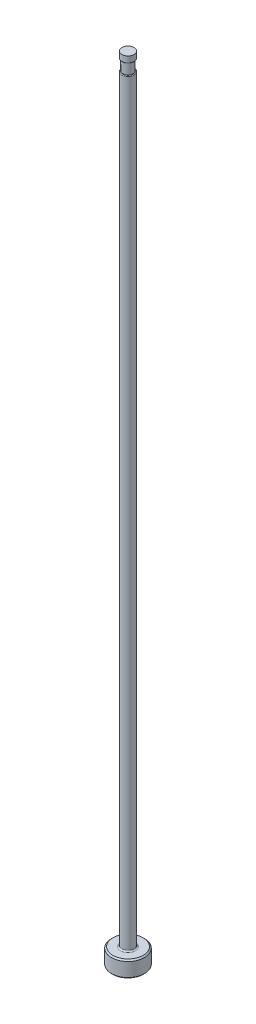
from build123d import *

# Parameters (mm, degrees)
CHAMFER1_SIZE     = 0.254
FILLET1_R         = 0.254
SKETCH2_W         = 0.2032
SKETCH2_H         = 2.032
D_SLOT_DEPTH      = 153.466131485
D_SLOT_DEPTH_BACK = 153.466131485
SKETCH5_W         = 0.01905
SKETCH5_H         = 1.27
FILLET2_R         = 0.127


with BuildPart() as part:
    # Sketch1 → Revolve1 (revolve)
    with BuildSketch(Plane.XY, mode=Mode.PRIVATE) as revolve1_sk:
        Polygon((0, 0), (-3.175, 0), (-3.175, 3.175), (-1.18999, 3.175), (-1.18999, 152.4), (0, 152.4), align=None)
    revolve(revolve1_sk.sketch.rotate(Axis((0, 259.958771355, 0), (0, -1, 0)), 270), axis=Axis((0, 259.958771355, 0), (0, -1, 0)))

    # Chamfer1
    chamfer1_edges = [part.edges().sort_by_distance(p)[0] for p in [
        (0, 3.175, -3.175),
        (0, 0, -3.175),
    ]]
    chamfer(chamfer1_edges, length=CHAMFER1_SIZE)

    # Fillet1
    fillet1_edges = [part.edges().sort_by_distance(p)[0] for p in [
        (0, 3.175, -1.18999),
    ]]
    fillet(fillet1_edges, radius=FILLET1_R)

    # Sketch2 → Vent Relief (revolve, cut)
    with BuildSketch(Plane.XY, mode=Mode.PRIVATE) as vent_relief_sk:
        with Locations((-1.08839, 150.114)):
            Rectangle(SKETCH2_W, SKETCH2_H)
    revolve(vent_relief_sk.sketch.rotate(Axis((0, 153.448281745, 0), (0, -1, 0)), 270), axis=Axis((0, 153.448281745, 0), (0, -1, 0)), mode=Mode.SUBTRACT)

    # Sketch3 → D-Slot (cut, two sides: drawn at the far end of the back side and taken through both)
    with BuildSketch(Plane.XY.offset(-D_SLOT_DEPTH_BACK)):
        with BuildLine():
            Line((-0.98679, 150.114), (-0.98679, 86.614))
            ThreePointArc((-0.98679, 86.614), (-1.038003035, 86.046038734), (-1.18999, 85.4964))
            Line((-1.18999, 85.4964), (-1.18999, 150.114))
            Line((-1.18999, 150.114), (-0.98679, 150.114))
        make_face()
    extrude(amount=D_SLOT_DEPTH + D_SLOT_DEPTH_BACK, mode=Mode.SUBTRACT)

    # Sketch5 → Vent Diameter (revolve, cut)
    with BuildSketch(Plane.XY, mode=Mode.PRIVATE) as vent_diameter_sk:
        with Locations((-1.180465, 151.765)):
            Rectangle(SKETCH5_W, SKETCH5_H)
    revolve(vent_diameter_sk.sketch.rotate(Axis((0, 152.687735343, 0), (0, -1, 0)), 90), axis=Axis((0, 152.687735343, 0), (0, -1, 0)), mode=Mode.SUBTRACT)

    # Fillet2
    fillet2_edges = [part.edges().sort_by_distance(p)[0] for p in [
        (1.050596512, 149.098, -0.55885881),
        (0, 151.13, 1.17094),
    ]]
    fillet(fillet2_edges, radius=FILLET2_R)


solid = part.part
